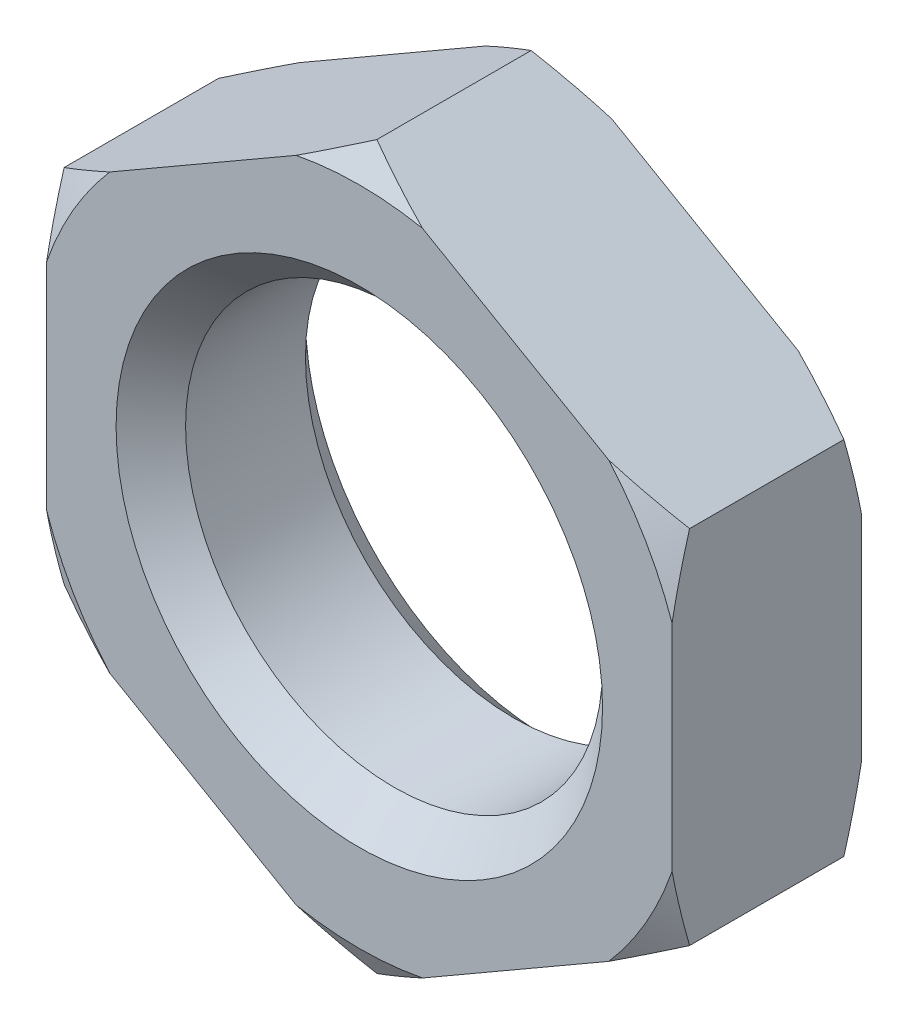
from build123d import *

# Parameters (mm, degrees)
SKETCH1_R           = 12
BOSS_EXTRUDE1_DEPTH = 5.45
CHAMFER1_SIZE       = 2


with BuildPart() as part:
    # Sketch1 → Boss-Extrude1 (new, symmetric)
    with BuildSketch(Plane.XY):
        Polygon((0, 20.784609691), (-18, 10.392304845), (-18, -10.392304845), (0, -20.784609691), (18, -10.392304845), (18, 10.392304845), align=None)
        Circle(SKETCH1_R, mode=Mode.SUBTRACT)
    extrude(amount=BOSS_EXTRUDE1_DEPTH, both=True)

    # Sketch3 → Cut-Revolve1 (revolve, cut)
    with BuildSketch(Plane(origin=(0, 0, 0), x_dir=(0, 0, -1), z_dir=(1, 0, 0))):
        Polygon((-5.45, 20.784609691), (-5.45, 19.034609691), (-4.439637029, 20.784609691), align=None)
    cut_revolve1 = revolve(axis=Axis((0, 0, -7.477018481), (0, 0, 1)), mode=Mode.SUBTRACT)

    # Mirror1: Cut-Revolve1 across plane
    add(cut_revolve1.mirror(Plane.XY), mode=Mode.SUBTRACT)

    # Chamfer1
    chamfer1_edges = [part.edges().sort_by_distance(p)[0] for p in [
        (-12, 0, -5.45),
        (-12, 0, 5.45),
    ]]
    chamfer(chamfer1_edges, length=CHAMFER1_SIZE)


solid = part.part
